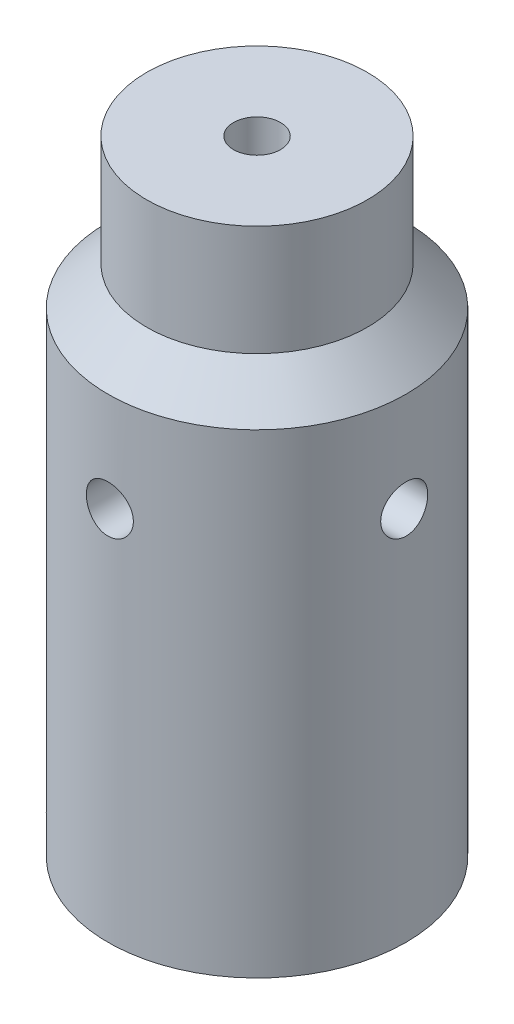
from build123d import *

# Parameters (mm, degrees)
SKETCH2_R          = 0.889
EXTRUDE1_DEPTH     = 9.525
SKETCH3_R          = 2.7051
EXTRUDE2_DEPTH     = 66.355661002
CIRPATTERN1_COUNT  = 2
CIRPATTERN1_ANGLE  = 90
SKETCH5_R          = 1.905
CUT_EXTRUDE1_DEPTH = 63.080790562


with BuildPart() as part:
    # Sketch1 → Revolve1 (revolve)
    with BuildSketch(Plane.XY):
        with BuildLine():
            Line((-0.889, 44.792858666), (-0.889, 48.26))
            Line((-0.889, 48.26), (-2.7051, 48.26))
            Line((-2.7051, 48.26), (-2.7051, 57.15))
            Line((-2.7051, 57.15), (-12.7, 57.15))
            Line((-12.7, 57.15), (-12.7, 44.45))
            Line((-12.7, 44.45), (-17.145, 40.005))
            Line((-17.145, 40.005), (-17.145, 23.495))
            Line((-17.145, 23.495), (-17.145, -14.605))
            Line((-17.145, -14.605), (-13.9573, -14.605))
            Line((-13.9573, -14.605), (-13.9573, -12.7))
            ThreePointArc((-13.9573, -12.7), (-15.8623, -10.795), (-13.9573, -8.89))
            Line((-13.9573, -8.89), (-13.9573, 0))
            Line((-13.9573, 0), (-6.7437, 0))
            Line((-6.7437, 0), (-6.7437, 16.637))
            Line((-6.7437, 16.637), (-7.874, 16.637))
            Line((-7.874, 16.637), (-7.874, 18.9992))
            Line((-7.874, 18.9992), (-6.7437, 18.9992))
            Line((-6.7437, 18.9992), (-6.7437, 41.275))
            Line((-6.7437, 41.275), (-0.889, 44.792858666))
        make_face()
    revolve(axis=Axis((0, 0, 0), (0, -1, 0)))

    # Sketch2 → Extrude1 (cut)
    with BuildSketch(Plane(origin=(0, 0, 0), x_dir=(0, 0, -1), z_dir=(1, 0, 0))):
        with Locations(Location((0, 28.575, 0), (0, 0, 180))):
            Circle(SKETCH2_R)
    extrude1 = extrude(amount=EXTRUDE1_DEPTH, mode=Mode.SUBTRACT)

    # Sketch3 → Extrude2 (cut, through all)
    with BuildSketch(Plane.ZY.offset(-9.525)):
        with Locations((0, 28.575)):
            Circle(SKETCH3_R)
    extrude2 = extrude(amount=-EXTRUDE2_DEPTH, mode=Mode.SUBTRACT)

    # Sketch4 → Cut-Revolve1 (revolve, cut)
    with BuildSketch(Plane.XY, mode=Mode.PRIVATE) as cut_revolve1_sk:
        Polygon((0, 32.5501), (0, 27.3939), (8.255, 27.3939), (8.255, 31.677550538), (6.7437, 32.5501), align=None)
    revolve(cut_revolve1_sk.sketch.rotate(Axis((0, 0, 0), (0, -1, 0)), 90), axis=Axis((0, 0, 0), (0, -1, 0)), mode=Mode.SUBTRACT)

    # CirPattern1: Extrude1, Extrude2 ×2 about axis
    cirpattern1_axis = Axis((0, -2.753299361, 0), (0, -1, 0))
    add([extrude1.rotate(cirpattern1_axis, i * CIRPATTERN1_ANGLE / (CIRPATTERN1_COUNT - 1)) for i in range(1, CIRPATTERN1_COUNT)], mode=Mode.SUBTRACT)
    add([extrude2.rotate(cirpattern1_axis, i * CIRPATTERN1_ANGLE / (CIRPATTERN1_COUNT - 1)) for i in range(1, CIRPATTERN1_COUNT)], mode=Mode.SUBTRACT)

    # Sketch5 → Cut-Extrude1 (cut, through all)
    with BuildSketch(Plane.XY):
        with Locations(Location((-13.9573, -10.795, 0), (0, 0, 180))):
            Circle(SKETCH5_R)
    extrude(amount=CUT_EXTRUDE1_DEPTH, mode=Mode.SUBTRACT)


solid = part.part
